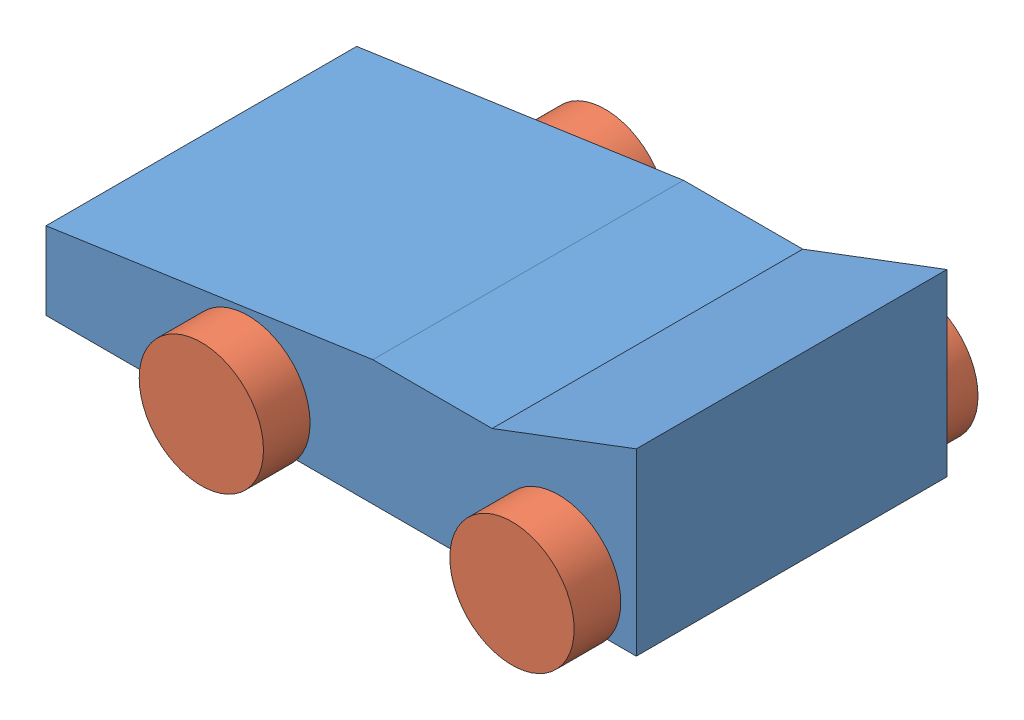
SolidWorks assembly toy_car_3.SLDASM, configuration Default (file format 14000). Lengths in mm.
Overall size (965.2 362.9 660.4).
5 component instances, 2 part files, 8 mates.
Components (placement in the parent):
- base1-1: base1.SLDPRT [Default] at origin size (965.2 293.63 508)
- wheel-1: wheel.SLDPRT [Default] at (295.7311 49.8468 508) size (203.2 203.2 152.4)
- wheel-2: wheel.SLDPRT [Default] at (803.7311 49.8468 508) size (203.2 203.2 152.4)
- wheel-4: wheel.SLDPRT [Default] at (803.7311 49.8468 0) x (-0.186189 -0.982514 0) z (0 0 -1) size (203.2 203.2 152.4)
- wheel-7: wheel.SLDPRT [Default] at (295.7311 49.8468 0) x (-0.923728 -0.383049 0) z (0 0 -1) size (203.2 203.2 152.4)
Mates (geometry in assembly coordinates):
- Coincident1: coincident anti-aligned: circle of base1-1; cylinder of wheel-4 through (803.7311 49.8468 76.2) axis (0 0 -1) radius 38.1
- Coincident3: coincident aligned: circle of base1-1; cylinder of wheel-2 through (803.7311 49.8468 431.8) axis (0 0 1) radius 38.1
- Coincident4: coincident aligned: circle of base1-1; cylinder of wheel-1 through (295.7311 49.8468 431.8) axis (0 0 1) radius 38.1
- Coincident5: coincident anti-aligned: plane of base1-1 through (0 0 508) normal (0 0 1); plane of wheel-2 through (803.7311 49.8468 508) normal (0 0 -1)
- Coincident6: coincident anti-aligned: plane of base1-1 through (0 0 508) normal (0 0 1); plane of wheel-1 through (295.7311 49.8468 508) normal (0 0 -1)
- Coincident7: coincident anti-aligned: plane of base1-1 through (0 0 0) normal (0 0 -1); plane of wheel-4 through (803.7311 49.8468 0) normal (0 0 1)
- Coincident17: coincident anti-aligned: circle of base1-1; cylinder of wheel-7 through (295.7311 49.8468 76.2) axis (0 0 -1) radius 38.1
- Coincident18: coincident anti-aligned: plane of base1-1 through (0 0 0) normal (0 0 -1); plane of wheel-7 through (295.7311 49.8468 0) normal (0 0 1)
